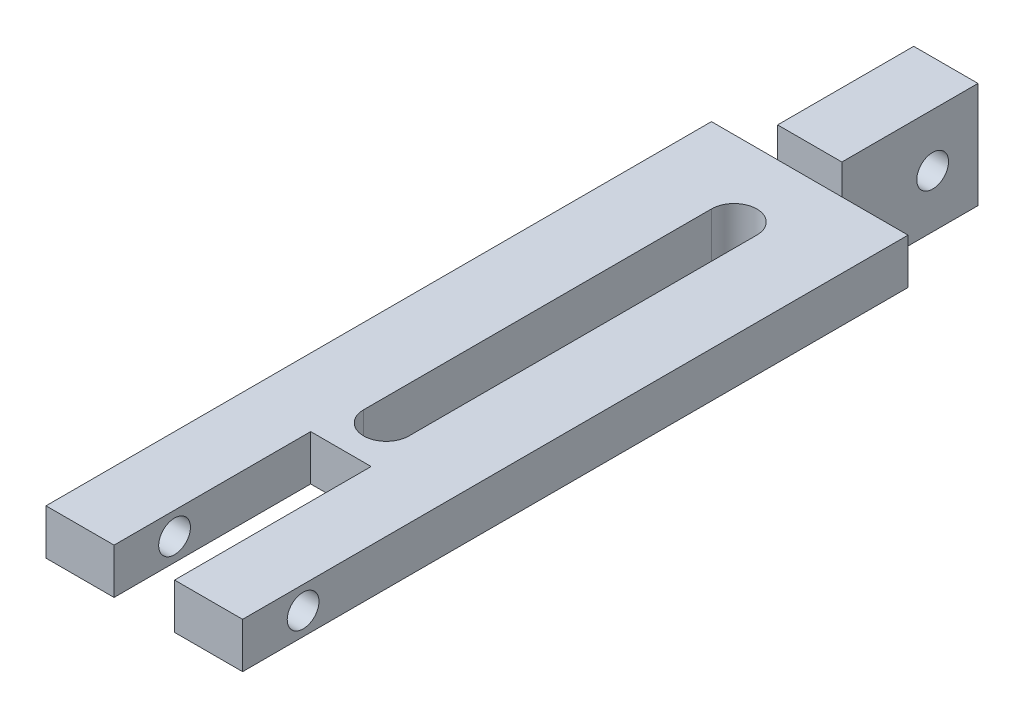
from build123d import *

# Parameters (mm, degrees)
F_01_ARM_BODY_DEPTH      = 3
SKETCH_2_W               = 8.5
SKETCH_2_H               = 18
F_02_NECK_BLOCK_DEPTH    = 7
F_03_SLOT_F_DEPTH        = 102.084123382
F_03_SLOT_B_DEPTH        = 102.084123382
SKETCH_5_R               = 2.1
F_04_PINHOLE_BOT_R_DEPTH = 102.084123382
SKETCH_6_R               = 2.1
F_04_PINHOLE_BOT_L_DEPTH = 102.084123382
SKETCH_7_R               = 2.1
F_04_PINHOLE_TOP_R_DEPTH = 102.084123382
SKETCH_8_R               = 2.1
F_04_PINHOLE_TOP_L_DEPTH = 102.084123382


with BuildPart() as part:
    # Sketch 1 → 01_ARM_BODY (new, symmetric)
    with BuildSketch(Plane(origin=(0, 0, 0), x_dir=(1, 0, 0), z_dir=(0, 1, 0))):
        Polygon((-4.25, 6), (4.25, 6), (4.25, -12), (13, -12), (13, -74), (13, -100), (4, -100), (4, -74), (-4, -74), (-4, -100), (-13, -100), (-13, -74), (-13, -12), (-4.25, -12), align=None)
    extrude(amount=F_01_ARM_BODY_DEPTH, both=True)

    # Sketch 2 → 02_NECK_BLOCK (add, symmetric)
    with BuildSketch(Plane(origin=(0, 0, 0), x_dir=(1, 0, 0), z_dir=(0, 1, 0))):
        with Locations((0, -3)):
            Rectangle(SKETCH_2_W, SKETCH_2_H)
    extrude(amount=F_02_NECK_BLOCK_DEPTH, both=True)

    # Sketch 3 → 03_SLOT_F (cut, through all)
    with BuildSketch(Plane(origin=(0, 0, 0), x_dir=(1, 0, 0), z_dir=(0, 1, 0))):
        with BuildLine():
            Line((3, -22), (3, -68))
            ThreePointArc((3, -68), (0, -71), (-3, -68))
            Line((-3, -68), (-3, -22))
            ThreePointArc((-3, -22), (0, -19), (3, -22))
        make_face()
    extrude(amount=F_03_SLOT_F_DEPTH, mode=Mode.SUBTRACT)

    # Sketch 4 → 03_SLOT_B (cut, through all)
    with BuildSketch(Plane(origin=(0, 0, 0), x_dir=(1, 0, 0), z_dir=(0, 1, 0))):
        with BuildLine():
            Line((3, -22), (3, -68))
            ThreePointArc((3, -68), (0, -71), (-3, -68))
            Line((-3, -68), (-3, -22))
            ThreePointArc((-3, -22), (0, -19), (3, -22))
        make_face()
    extrude(amount=-F_03_SLOT_B_DEPTH, mode=Mode.SUBTRACT)

    # Sketch 5 → 04_PINHOLE_BOT_R (cut, through all)
    with BuildSketch(Plane(origin=(0, 0, 0), x_dir=(0, 0, -1), z_dir=(1, 0, 0))):
        with Locations(Location((0, 0, 0), (0, 0, 180))):
            Circle(SKETCH_5_R)
    extrude(amount=F_04_PINHOLE_BOT_R_DEPTH, mode=Mode.SUBTRACT)

    # Sketch 6 → 04_PINHOLE_BOT_L (cut, through all)
    with BuildSketch(Plane(origin=(0, 0, 0), x_dir=(0, 0, -1), z_dir=(1, 0, 0))):
        with Locations(Location((0, 0, 0), (0, 0, 180))):
            Circle(SKETCH_6_R)
    extrude(amount=-F_04_PINHOLE_BOT_L_DEPTH, mode=Mode.SUBTRACT)

    # Sketch 7 → 04_PINHOLE_TOP_R (cut, through all)
    with BuildSketch(Plane(origin=(0, 0, 0), x_dir=(0, 0, -1), z_dir=(1, 0, 0))):
        with Locations(Location((-92, 0, 0), (0, 0, 180))):
            Circle(SKETCH_7_R)
    extrude(amount=F_04_PINHOLE_TOP_R_DEPTH, mode=Mode.SUBTRACT)

    # Sketch 8 → 04_PINHOLE_TOP_L (cut, through all)
    with BuildSketch(Plane(origin=(0, 0, 0), x_dir=(0, 0, -1), z_dir=(1, 0, 0))):
        with Locations(Location((-92, 0, 0), (0, 0, 180))):
            Circle(SKETCH_8_R)
    extrude(amount=-F_04_PINHOLE_TOP_L_DEPTH, mode=Mode.SUBTRACT)


solid = part.part
